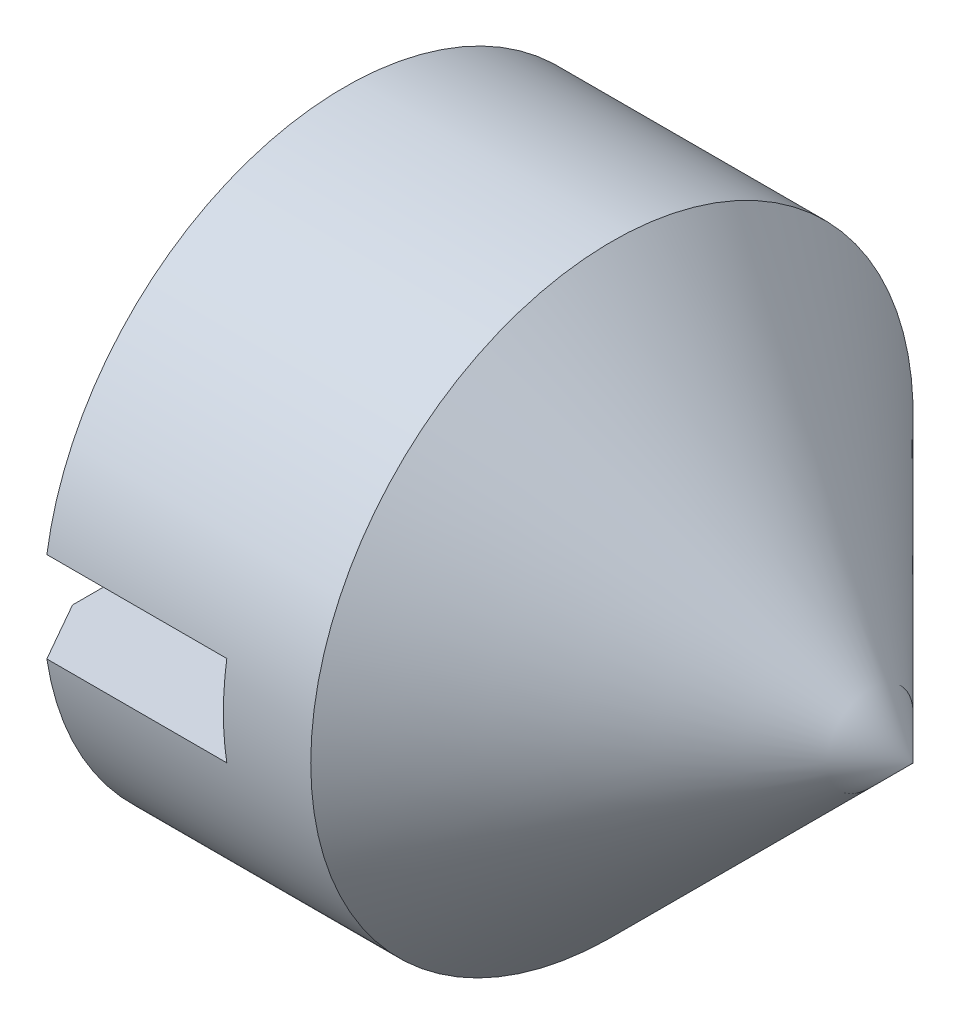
from build123d import *

# Parameters (mm, degrees)
SKETCH2_W  = 4
SKETCH2_H  = 0.6
SLOT_DEPTH = 1.42


with BuildPart() as part:
    # BodySke → BaseBody (revolve)
    with BuildSketch(Plane.XY, mode=Mode.PRIVATE) as basebody_sk:
        Polygon((0, 0), (0, 1.61), (0.225166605, 2), (2, 2), (4, 0), align=None)
    revolve(basebody_sk.sketch.rotate(Axis((-12.7, 0, 0), (1, 0, 0)), 90), axis=Axis((-12.7, 0, 0), (1, 0, 0)))

    # Sketch2 → Slot (cut)
    with BuildSketch(Plane.ZY):
        Rectangle(SKETCH2_W, SKETCH2_H)
    extrude(amount=-SLOT_DEPTH, mode=Mode.SUBTRACT)


solid = part.part
